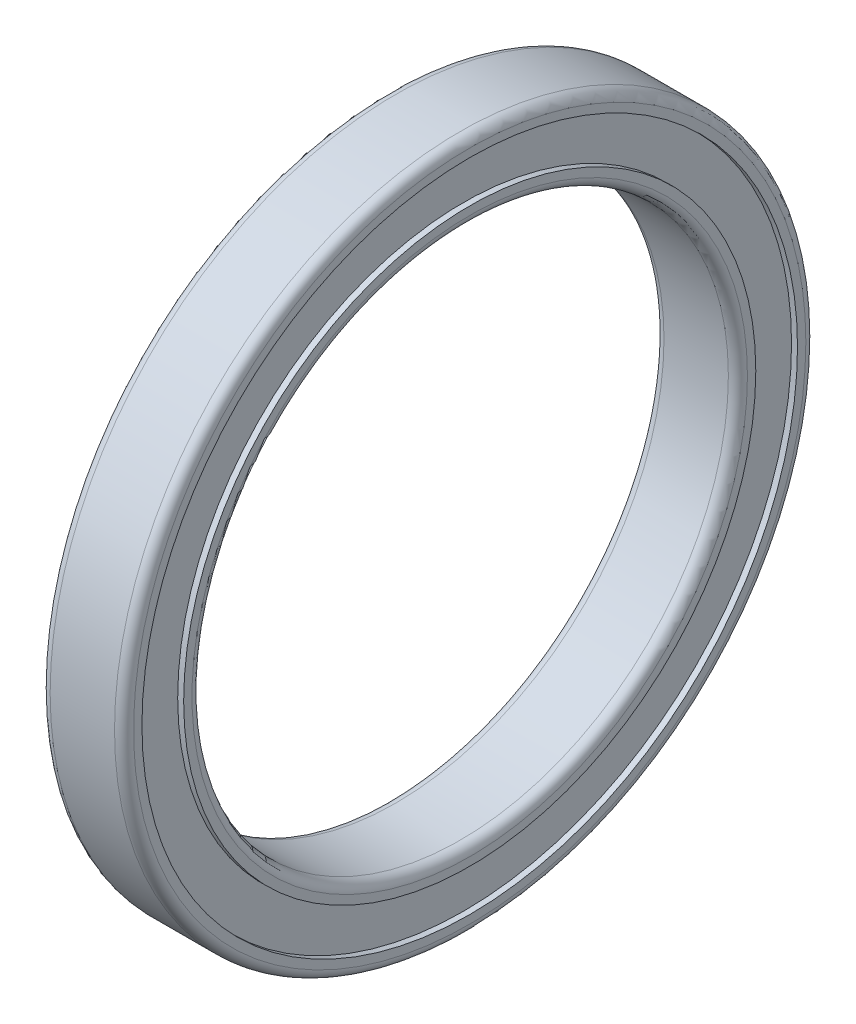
ISO-10303-21;
HEADER;
FILE_DESCRIPTION(('STEP AP214'),'2;1');
FILE_NAME('part.step','',(''),(''),'','','');
FILE_SCHEMA(('AUTOMOTIVE_DESIGN { 1 0 10303 214 1 1 1 1 }'));
ENDSEC;
DATA;
#1=APPLICATION_CONTEXT('core data for automotive mechanical design processes');
#2=APPLICATION_PROTOCOL_DEFINITION('international standard','automotive_design',2000,#1);
#3=PRODUCT_CONTEXT('',#1,'mechanical');
#4=PRODUCT('Part','Part','',(#3));
#5=PRODUCT_RELATED_PRODUCT_CATEGORY('part','',(#4));
#6=PRODUCT_DEFINITION_FORMATION('','',#4);
#7=PRODUCT_DEFINITION_CONTEXT('part definition',#1,'design');
#8=PRODUCT_DEFINITION('design','',#6,#7);
#9=PRODUCT_DEFINITION_SHAPE('','',#8);
#10=(LENGTH_UNIT() NAMED_UNIT(*) SI_UNIT(.MILLI.,.METRE.));
#11=(NAMED_UNIT(*) PLANE_ANGLE_UNIT() SI_UNIT($,.RADIAN.));
#12=(NAMED_UNIT(*) SI_UNIT($,.STERADIAN.) SOLID_ANGLE_UNIT());
#13=UNCERTAINTY_MEASURE_WITH_UNIT(LENGTH_MEASURE(1.E-05),#10,'distance_accuracy_value','');
#14=(GEOMETRIC_REPRESENTATION_CONTEXT(3) GLOBAL_UNCERTAINTY_ASSIGNED_CONTEXT((#13)) GLOBAL_UNIT_ASSIGNED_CONTEXT((#10,
#11,#12)) REPRESENTATION_CONTEXT('',''));
#15=CARTESIAN_POINT('',(0.,0.,0.));
#16=DIRECTION('',(0.,0.,1.));
#17=DIRECTION('',(1.,0.,0.));
#18=AXIS2_PLACEMENT_3D('',#15,#16,#17);
#19=CARTESIAN_POINT('',(-3.5,22.5,0.));
#20=DIRECTION('',(-1.,0.,0.));
#21=DIRECTION('',(0.,0.,1.));
#22=AXIS2_PLACEMENT_3D('',#19,#20,#21);
#23=PLANE('',#22);
#24=CARTESIAN_POINT('',(-3.5,0.,0.));
#25=DIRECTION('',(-1.,0.,0.));
#26=DIRECTION('',(0.,0.,1.));
#27=AXIS2_PLACEMENT_3D('',#24,#25,#26);
#28=CIRCLE('',#27,23.3);
#29=CARTESIAN_POINT('',(-3.5,0.,23.3));
#30=VERTEX_POINT('',#29);
#31=EDGE_CURVE('E52',#30,#30,#28,.F.);
#32=ORIENTED_EDGE('',*,*,#31,.T.);
#33=EDGE_LOOP('',(#32));
#34=FACE_BOUND('',#33,.T.);
#35=CARTESIAN_POINT('',(-3.5,0.,0.));
#36=DIRECTION('',(1.,0.,0.));
#37=DIRECTION('',(0.,0.,-1.));
#38=AXIS2_PLACEMENT_3D('',#35,#36,#37);
#39=CIRCLE('',#38,24.);
#40=CARTESIAN_POINT('',(-3.5,0.,-24.));
#41=VERTEX_POINT('',#40);
#42=EDGE_CURVE('E90',#41,#41,#39,.T.);
#43=ORIENTED_EDGE('',*,*,#42,.F.);
#44=EDGE_LOOP('',(#43));
#45=FACE_BOUND('',#44,.T.);
#46=ADVANCED_FACE('F37',(#34,#45),#23,.T.);
#47=CARTESIAN_POINT('',(0.,0.,0.));
#48=DIRECTION('',(1.,0.,0.));
#49=DIRECTION('',(0.,0.,-1.));
#50=AXIS2_PLACEMENT_3D('',#47,#48,#49);
#51=CYLINDRICAL_SURFACE('',#50,22.5);
#52=CARTESIAN_POINT('',(-2.7,0.,0.));
#53=DIRECTION('',(-1.,0.,0.));
#54=DIRECTION('',(0.,0.,1.));
#55=AXIS2_PLACEMENT_3D('',#52,#53,#54);
#56=CIRCLE('',#55,22.5);
#57=CARTESIAN_POINT('',(-2.7,0.,22.5));
#58=VERTEX_POINT('',#57);
#59=EDGE_CURVE('E44',#58,#58,#56,.T.);
#60=ORIENTED_EDGE('',*,*,#59,.T.);
#61=EDGE_LOOP('',(#60));
#62=FACE_BOUND('',#61,.T.);
#63=CARTESIAN_POINT('',(2.7,0.,0.));
#64=DIRECTION('',(1.,0.,0.));
#65=DIRECTION('',(0.,0.,-1.));
#66=AXIS2_PLACEMENT_3D('',#63,#64,#65);
#67=CIRCLE('',#66,22.5);
#68=CARTESIAN_POINT('',(2.7,0.,-22.5));
#69=VERTEX_POINT('',#68);
#70=EDGE_CURVE('E48',#69,#69,#67,.T.);
#71=ORIENTED_EDGE('',*,*,#70,.T.);
#72=EDGE_LOOP('',(#71));
#73=FACE_BOUND('',#72,.T.);
#74=ADVANCED_FACE('F98',(#62,#73),#51,.F.);
#75=CARTESIAN_POINT('',(3.5,22.5,0.));
#76=DIRECTION('',(1.,0.,0.));
#77=DIRECTION('',(0.,0.,-1.));
#78=AXIS2_PLACEMENT_3D('',#75,#76,#77);
#79=PLANE('',#78);
#80=CARTESIAN_POINT('',(3.5,0.,0.));
#81=DIRECTION('',(1.,0.,0.));
#82=DIRECTION('',(0.,0.,-1.));
#83=AXIS2_PLACEMENT_3D('',#80,#81,#82);
#84=CIRCLE('',#83,23.3);
#85=CARTESIAN_POINT('',(3.5,0.,-23.3));
#86=VERTEX_POINT('',#85);
#87=EDGE_CURVE('E10',#86,#86,#84,.F.);
#88=ORIENTED_EDGE('',*,*,#87,.T.);
#89=EDGE_LOOP('',(#88));
#90=FACE_BOUND('',#89,.T.);
#91=CARTESIAN_POINT('',(3.5,0.,0.));
#92=DIRECTION('',(1.,0.,0.));
#93=DIRECTION('',(0.,0.,-1.));
#94=AXIS2_PLACEMENT_3D('',#91,#92,#93);
#95=CIRCLE('',#94,24.);
#96=CARTESIAN_POINT('',(3.5,0.,-24.));
#97=VERTEX_POINT('',#96);
#98=EDGE_CURVE('E69',#97,#97,#95,.T.);
#99=ORIENTED_EDGE('',*,*,#98,.T.);
#100=EDGE_LOOP('',(#99));
#101=FACE_BOUND('',#100,.T.);
#102=ADVANCED_FACE('F104',(#90,#101),#79,.T.);
#103=CARTESIAN_POINT('',(0.,0.,0.));
#104=DIRECTION('',(1.,0.,0.));
#105=DIRECTION('',(0.,0.,-1.));
#106=AXIS2_PLACEMENT_3D('',#103,#104,#105);
#107=CYLINDRICAL_SURFACE('',#106,24.);
#108=CARTESIAN_POINT('',(3.,0.,0.));
#109=DIRECTION('',(1.,0.,0.));
#110=DIRECTION('',(0.,0.,-1.));
#111=AXIS2_PLACEMENT_3D('',#108,#109,#110);
#112=CIRCLE('',#111,24.);
#113=CARTESIAN_POINT('',(3.,0.,-24.));
#114=VERTEX_POINT('',#113);
#115=EDGE_CURVE('E72',#114,#114,#112,.T.);
#116=ORIENTED_EDGE('',*,*,#115,.T.);
#117=EDGE_LOOP('',(#116));
#118=FACE_BOUND('',#117,.T.);
#119=ORIENTED_EDGE('',*,*,#98,.F.);
#120=EDGE_LOOP('',(#119));
#121=FACE_BOUND('',#120,.T.);
#122=ADVANCED_FACE('F192',(#118,#121),#107,.T.);
#123=CARTESIAN_POINT('',(3.,24.,0.));
#124=DIRECTION('',(1.,0.,0.));
#125=DIRECTION('',(0.,0.,-1.));
#126=AXIS2_PLACEMENT_3D('',#123,#124,#125);
#127=PLANE('',#126);
#128=CARTESIAN_POINT('',(3.,0.,0.));
#129=DIRECTION('',(1.,0.,0.));
#130=DIRECTION('',(0.,0.,-1.));
#131=AXIS2_PLACEMENT_3D('',#128,#129,#130);
#132=CIRCLE('',#131,27.5);
#133=CARTESIAN_POINT('',(3.,0.,-27.5));
#134=VERTEX_POINT('',#133);
#135=EDGE_CURVE('E75',#134,#134,#132,.T.);
#136=ORIENTED_EDGE('',*,*,#135,.T.);
#137=EDGE_LOOP('',(#136));
#138=FACE_BOUND('',#137,.T.);
#139=ORIENTED_EDGE('',*,*,#115,.F.);
#140=EDGE_LOOP('',(#139));
#141=FACE_BOUND('',#140,.T.);
#142=ADVANCED_FACE('F235',(#138,#141),#127,.T.);
#143=CARTESIAN_POINT('',(0.,0.,0.));
#144=DIRECTION('',(1.,0.,0.));
#145=DIRECTION('',(0.,0.,-1.));
#146=AXIS2_PLACEMENT_3D('',#143,#144,#145);
#147=CYLINDRICAL_SURFACE('',#146,27.5);
#148=CARTESIAN_POINT('',(3.5,0.,0.));
#149=DIRECTION('',(1.,0.,0.));
#150=DIRECTION('',(0.,0.,-1.));
#151=AXIS2_PLACEMENT_3D('',#148,#149,#150);
#152=CIRCLE('',#151,27.5);
#153=CARTESIAN_POINT('',(3.5,0.,-27.5));
#154=VERTEX_POINT('',#153);
#155=EDGE_CURVE('E78',#154,#154,#152,.T.);
#156=ORIENTED_EDGE('',*,*,#155,.T.);
#157=EDGE_LOOP('',(#156));
#158=FACE_BOUND('',#157,.T.);
#159=ORIENTED_EDGE('',*,*,#135,.F.);
#160=EDGE_LOOP('',(#159));
#161=FACE_BOUND('',#160,.T.);
#162=ADVANCED_FACE('F180',(#158,#161),#147,.F.);
#163=CARTESIAN_POINT('',(3.5,27.5,0.));
#164=DIRECTION('',(1.,0.,0.));
#165=DIRECTION('',(0.,0.,-1.));
#166=AXIS2_PLACEMENT_3D('',#163,#164,#165);
#167=PLANE('',#166);
#168=CARTESIAN_POINT('',(3.5,0.,0.));
#169=DIRECTION('',(1.,0.,0.));
#170=DIRECTION('',(0.,0.,-1.));
#171=AXIS2_PLACEMENT_3D('',#168,#169,#170);
#172=CIRCLE('',#171,28.2);
#173=CARTESIAN_POINT('',(3.5,0.,-28.2));
#174=VERTEX_POINT('',#173);
#175=EDGE_CURVE('E66',#174,#174,#172,.T.);
#176=ORIENTED_EDGE('',*,*,#175,.T.);
#177=EDGE_LOOP('',(#176));
#178=FACE_BOUND('',#177,.T.);
#179=ORIENTED_EDGE('',*,*,#155,.F.);
#180=EDGE_LOOP('',(#179));
#181=FACE_BOUND('',#180,.T.);
#182=ADVANCED_FACE('F170',(#178,#181),#167,.T.);
#183=CARTESIAN_POINT('',(0.,0.,0.));
#184=DIRECTION('',(1.,0.,0.));
#185=DIRECTION('',(0.,0.,-1.));
#186=AXIS2_PLACEMENT_3D('',#183,#184,#185);
#187=CYLINDRICAL_SURFACE('',#186,29.);
#188=CARTESIAN_POINT('',(2.7,0.,0.));
#189=DIRECTION('',(1.,0.,0.));
#190=DIRECTION('',(0.,0.,-1.));
#191=AXIS2_PLACEMENT_3D('',#188,#189,#190);
#192=CIRCLE('',#191,29.);
#193=CARTESIAN_POINT('',(2.7,0.,-29.));
#194=VERTEX_POINT('',#193);
#195=EDGE_CURVE('E60',#194,#194,#192,.F.);
#196=ORIENTED_EDGE('',*,*,#195,.T.);
#197=EDGE_LOOP('',(#196));
#198=FACE_BOUND('',#197,.T.);
#199=CARTESIAN_POINT('',(-2.7,0.,0.));
#200=DIRECTION('',(-1.,0.,0.));
#201=DIRECTION('',(0.,0.,1.));
#202=AXIS2_PLACEMENT_3D('',#199,#200,#201);
#203=CIRCLE('',#202,29.);
#204=CARTESIAN_POINT('',(-2.7,0.,29.));
#205=VERTEX_POINT('',#204);
#206=EDGE_CURVE('E63',#205,#205,#203,.F.);
#207=ORIENTED_EDGE('',*,*,#206,.T.);
#208=EDGE_LOOP('',(#207));
#209=FACE_BOUND('',#208,.T.);
#210=ADVANCED_FACE('F158',(#198,#209),#187,.T.);
#211=CARTESIAN_POINT('',(-3.5,27.5,0.));
#212=DIRECTION('',(-1.,0.,0.));
#213=DIRECTION('',(0.,0.,1.));
#214=AXIS2_PLACEMENT_3D('',#211,#212,#213);
#215=PLANE('',#214);
#216=CARTESIAN_POINT('',(-3.5,0.,0.));
#217=DIRECTION('',(-1.,0.,0.));
#218=DIRECTION('',(0.,0.,1.));
#219=AXIS2_PLACEMENT_3D('',#216,#217,#218);
#220=CIRCLE('',#219,28.2);
#221=CARTESIAN_POINT('',(-3.5,0.,28.2));
#222=VERTEX_POINT('',#221);
#223=EDGE_CURVE('E57',#222,#222,#220,.T.);
#224=ORIENTED_EDGE('',*,*,#223,.T.);
#225=EDGE_LOOP('',(#224));
#226=FACE_BOUND('',#225,.T.);
#227=CARTESIAN_POINT('',(-3.5,0.,0.));
#228=DIRECTION('',(1.,0.,0.));
#229=DIRECTION('',(0.,0.,-1.));
#230=AXIS2_PLACEMENT_3D('',#227,#228,#229);
#231=CIRCLE('',#230,27.5);
#232=CARTESIAN_POINT('',(-3.5,0.,-27.5));
#233=VERTEX_POINT('',#232);
#234=EDGE_CURVE('E81',#233,#233,#231,.T.);
#235=ORIENTED_EDGE('',*,*,#234,.T.);
#236=EDGE_LOOP('',(#235));
#237=FACE_BOUND('',#236,.T.);
#238=ADVANCED_FACE('F152',(#226,#237),#215,.T.);
#239=CARTESIAN_POINT('',(0.,0.,0.));
#240=DIRECTION('',(1.,0.,0.));
#241=DIRECTION('',(0.,0.,-1.));
#242=AXIS2_PLACEMENT_3D('',#239,#240,#241);
#243=CYLINDRICAL_SURFACE('',#242,27.5);
#244=CARTESIAN_POINT('',(-3.,0.,0.));
#245=DIRECTION('',(1.,0.,0.));
#246=DIRECTION('',(0.,0.,-1.));
#247=AXIS2_PLACEMENT_3D('',#244,#245,#246);
#248=CIRCLE('',#247,27.5);
#249=CARTESIAN_POINT('',(-3.,0.,-27.5));
#250=VERTEX_POINT('',#249);
#251=EDGE_CURVE('E84',#250,#250,#248,.T.);
#252=ORIENTED_EDGE('',*,*,#251,.T.);
#253=EDGE_LOOP('',(#252));
#254=FACE_BOUND('',#253,.T.);
#255=ORIENTED_EDGE('',*,*,#234,.F.);
#256=EDGE_LOOP('',(#255));
#257=FACE_BOUND('',#256,.T.);
#258=ADVANCED_FACE('F157',(#254,#257),#243,.F.);
#259=CARTESIAN_POINT('',(-3.,24.,0.));
#260=DIRECTION('',(-1.,0.,0.));
#261=DIRECTION('',(0.,0.,1.));
#262=AXIS2_PLACEMENT_3D('',#259,#260,#261);
#263=PLANE('',#262);
#264=CARTESIAN_POINT('',(-3.,0.,0.));
#265=DIRECTION('',(1.,0.,0.));
#266=DIRECTION('',(0.,0.,-1.));
#267=AXIS2_PLACEMENT_3D('',#264,#265,#266);
#268=CIRCLE('',#267,24.);
#269=CARTESIAN_POINT('',(-3.,0.,-24.));
#270=VERTEX_POINT('',#269);
#271=EDGE_CURVE('E87',#270,#270,#268,.T.);
#272=ORIENTED_EDGE('',*,*,#271,.T.);
#273=EDGE_LOOP('',(#272));
#274=FACE_BOUND('',#273,.T.);
#275=ORIENTED_EDGE('',*,*,#251,.F.);
#276=EDGE_LOOP('',(#275));
#277=FACE_BOUND('',#276,.T.);
#278=ADVANCED_FACE('F210',(#274,#277),#263,.T.);
#279=CARTESIAN_POINT('',(0.,0.,0.));
#280=DIRECTION('',(1.,0.,0.));
#281=DIRECTION('',(0.,0.,-1.));
#282=AXIS2_PLACEMENT_3D('',#279,#280,#281);
#283=CYLINDRICAL_SURFACE('',#282,24.);
#284=ORIENTED_EDGE('',*,*,#42,.T.);
#285=EDGE_LOOP('',(#284));
#286=FACE_BOUND('',#285,.T.);
#287=ORIENTED_EDGE('',*,*,#271,.F.);
#288=EDGE_LOOP('',(#287));
#289=FACE_BOUND('',#288,.T.);
#290=ADVANCED_FACE('F94',(#286,#289),#283,.T.);
#291=CARTESIAN_POINT('',(2.7,0.,0.));
#292=DIRECTION('',(1.,0.,0.));
#293=DIRECTION('',(0.,0.,-1.));
#294=AXIS2_PLACEMENT_3D('',#291,#292,#293);
#295=TOROIDAL_SURFACE('',#294,28.2,0.8);
#296=ORIENTED_EDGE('',*,*,#195,.F.);
#297=EDGE_LOOP('',(#296));
#298=FACE_BOUND('',#297,.T.);
#299=ORIENTED_EDGE('',*,*,#175,.F.);
#300=EDGE_LOOP('',(#299));
#301=FACE_BOUND('',#300,.T.);
#302=ADVANCED_FACE('F108',(#298,#301),#295,.T.);
#303=CARTESIAN_POINT('',(-2.7,0.,0.));
#304=DIRECTION('',(-1.,0.,0.));
#305=DIRECTION('',(0.,0.,1.));
#306=AXIS2_PLACEMENT_3D('',#303,#304,#305);
#307=TOROIDAL_SURFACE('',#306,28.2,0.8);
#308=ORIENTED_EDGE('',*,*,#223,.F.);
#309=EDGE_LOOP('',(#308));
#310=FACE_BOUND('',#309,.T.);
#311=ORIENTED_EDGE('',*,*,#206,.F.);
#312=EDGE_LOOP('',(#311));
#313=FACE_BOUND('',#312,.T.);
#314=ADVANCED_FACE('F111',(#310,#313),#307,.T.);
#315=CARTESIAN_POINT('',(-2.7,0.,0.));
#316=DIRECTION('',(-1.,0.,0.));
#317=DIRECTION('',(0.,0.,1.));
#318=AXIS2_PLACEMENT_3D('',#315,#316,#317);
#319=TOROIDAL_SURFACE('',#318,23.3,0.8);
#320=ORIENTED_EDGE('',*,*,#59,.F.);
#321=EDGE_LOOP('',(#320));
#322=FACE_BOUND('',#321,.T.);
#323=ORIENTED_EDGE('',*,*,#31,.F.);
#324=EDGE_LOOP('',(#323));
#325=FACE_BOUND('',#324,.T.);
#326=ADVANCED_FACE('F114',(#322,#325),#319,.T.);
#327=CARTESIAN_POINT('',(2.7,0.,0.));
#328=DIRECTION('',(1.,0.,0.));
#329=DIRECTION('',(0.,0.,-1.));
#330=AXIS2_PLACEMENT_3D('',#327,#328,#329);
#331=TOROIDAL_SURFACE('',#330,23.3,0.8);
#332=ORIENTED_EDGE('',*,*,#87,.F.);
#333=EDGE_LOOP('',(#332));
#334=FACE_BOUND('',#333,.T.);
#335=ORIENTED_EDGE('',*,*,#70,.F.);
#336=EDGE_LOOP('',(#335));
#337=FACE_BOUND('',#336,.T.);
#338=ADVANCED_FACE('F39',(#334,#337),#331,.T.);
#339=CLOSED_SHELL('',(#46,#74,#102,#122,#142,#162,#182,#210,#238,#258,#278,#290,#302,#314,#326,#338));
#340=MANIFOLD_SOLID_BREP('B2',#339);
#341=ADVANCED_BREP_SHAPE_REPRESENTATION('',(#18,#340),#14);
#342=SHAPE_DEFINITION_REPRESENTATION(#9,#341);
ENDSEC;
END-ISO-10303-21;
